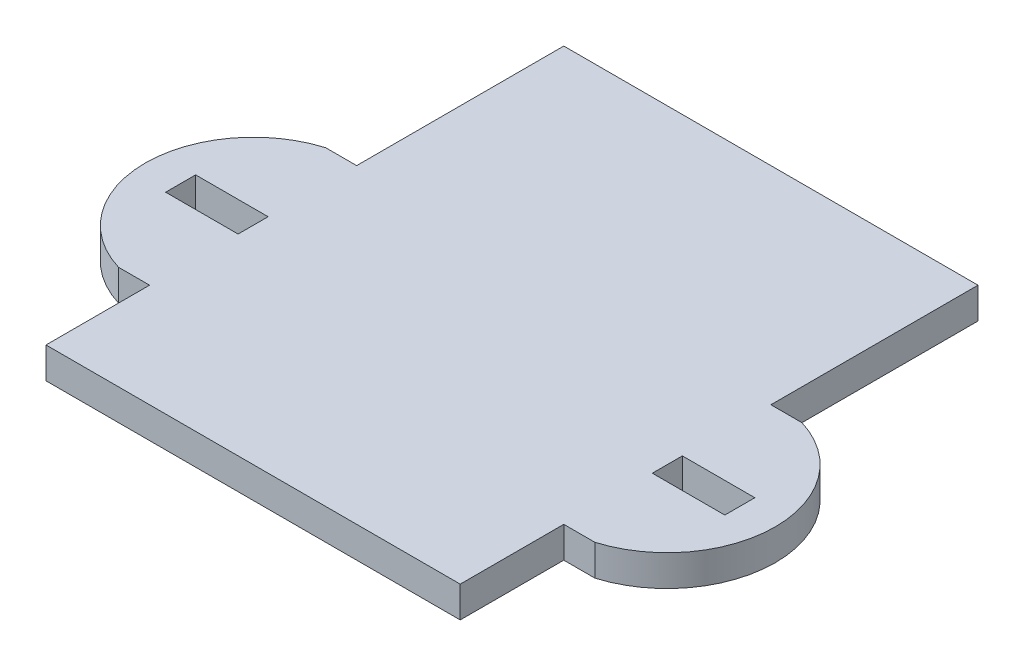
from build123d import *

# Parameters (mm, degrees)
ESQUISSE1_W        = 7
ESQUISSE1_H        = 2.9
BOSS_EXTRU_1_DEPTH = 3


with BuildPart() as part:
    # Esquisse1 → Boss.-Extru.1 (new body)
    with BuildSketch(Plane(origin=(0, 0, 0), x_dir=(1, 0, 0), z_dir=(0, 1, 0))):
        with BuildLine():
            ThreePointArc((23, 5), (30.424807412, -5), (23, -15))
            Line((23, -15), (20, -15))
            Line((20, -15), (20, -25))
            Line((20, -25), (-20, -25))
            Line((-20, -25), (-20, -15))
            Line((-20, -15), (-23, -15))
            ThreePointArc((-23, -15), (-30.424807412, -5), (-23, 5))
            Line((-23, 5), (-20, 5))
            Line((-20, 5), (-20, 25))
            Line((-20, 25), (20, 25))
            Line((20, 25), (20, 5))
            Line((20, 5), (23, 5))
        make_face()
        with Locations((-23.5, -5)):
            Rectangle(ESQUISSE1_W, ESQUISSE1_H, mode=Mode.SUBTRACT)
        with Locations((23.5, -5)):
            Rectangle(ESQUISSE1_W, ESQUISSE1_H, mode=Mode.SUBTRACT)
    extrude(amount=BOSS_EXTRU_1_DEPTH)


solid = part.part
